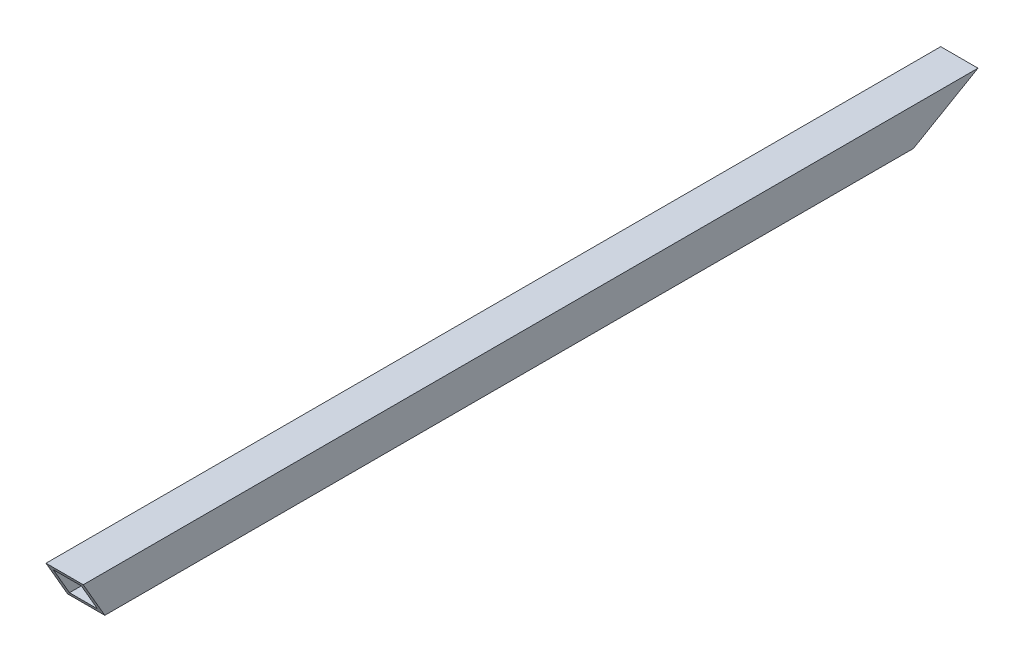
ISO-10303-21;
HEADER;
FILE_DESCRIPTION(('STEP AP214'),'2;1');
FILE_NAME('part.step','',(''),(''),'','','');
FILE_SCHEMA(('AUTOMOTIVE_DESIGN { 1 0 10303 214 1 1 1 1 }'));
ENDSEC;
DATA;
#1=APPLICATION_CONTEXT('core data for automotive mechanical design processes');
#2=APPLICATION_PROTOCOL_DEFINITION('international standard','automotive_design',2000,#1);
#3=PRODUCT_CONTEXT('',#1,'mechanical');
#4=PRODUCT('Part','Part','',(#3));
#5=PRODUCT_RELATED_PRODUCT_CATEGORY('part','',(#4));
#6=PRODUCT_DEFINITION_FORMATION('','',#4);
#7=PRODUCT_DEFINITION_CONTEXT('part definition',#1,'design');
#8=PRODUCT_DEFINITION('design','',#6,#7);
#9=PRODUCT_DEFINITION_SHAPE('','',#8);
#10=(LENGTH_UNIT() NAMED_UNIT(*) SI_UNIT(.MILLI.,.METRE.));
#11=(NAMED_UNIT(*) PLANE_ANGLE_UNIT() SI_UNIT($,.RADIAN.));
#12=(NAMED_UNIT(*) SI_UNIT($,.STERADIAN.) SOLID_ANGLE_UNIT());
#13=UNCERTAINTY_MEASURE_WITH_UNIT(LENGTH_MEASURE(1.E-05),#10,'distance_accuracy_value','');
#14=(GEOMETRIC_REPRESENTATION_CONTEXT(3) GLOBAL_UNCERTAINTY_ASSIGNED_CONTEXT((#13)) GLOBAL_UNIT_ASSIGNED_CONTEXT((#10,
#11,#12)) REPRESENTATION_CONTEXT('',''));
#15=CARTESIAN_POINT('',(0.,0.,0.));
#16=DIRECTION('',(0.,0.,1.));
#17=DIRECTION('',(1.,0.,0.));
#18=AXIS2_PLACEMENT_3D('',#15,#16,#17);
#19=CARTESIAN_POINT('',(-12.7000000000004,-12.7000000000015,-609.599999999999));
#20=DIRECTION('',(-1.,0.,0.));
#21=DIRECTION('',(0.,0.,1.));
#22=AXIS2_PLACEMENT_3D('',#19,#20,#21);
#23=PLANE('',#22);
#24=DIRECTION('',(0.,0.,1.));
#25=VECTOR('',#24,1.);
#26=CARTESIAN_POINT('',(-12.6999999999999,12.6999999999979,-609.599999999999));
#27=LINE('',#26,#25);
#28=CARTESIAN_POINT('',(-12.6999999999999,12.6999999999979,-609.599999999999));
#29=VERTEX_POINT('',#28);
#30=CARTESIAN_POINT('',(-12.7000000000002,12.7000000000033,5.55111512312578E-12));
#31=VERTEX_POINT('',#30);
#32=EDGE_CURVE('E123',#29,#31,#27,.T.);
#33=ORIENTED_EDGE('',*,*,#32,.F.);
#34=DIRECTION('',(0.,-0.500000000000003,0.866025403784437));
#35=VECTOR('',#34,1.);
#36=CARTESIAN_POINT('',(-12.6999999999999,6.34999999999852,-598.601477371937));
#37=LINE('',#36,#35);
#38=CARTESIAN_POINT('',(-12.6999999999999,-12.6999999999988,-565.605909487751));
#39=VERTEX_POINT('',#38);
#40=EDGE_CURVE('E105',#29,#39,#37,.T.);
#41=ORIENTED_EDGE('',*,*,#40,.T.);
#42=DIRECTION('',(0.,0.,1.));
#43=VECTOR('',#42,1.);
#44=CARTESIAN_POINT('',(-12.7000000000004,-12.7000000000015,-609.599999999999));
#45=LINE('',#44,#43);
#46=CARTESIAN_POINT('',(-12.7000000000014,-12.6999999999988,-14.6646968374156));
#47=VERTEX_POINT('',#46);
#48=EDGE_CURVE('E109',#39,#47,#45,.T.);
#49=ORIENTED_EDGE('',*,*,#48,.T.);
#50=DIRECTION('',(0.,-0.866025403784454,-0.500000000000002));
#51=VECTOR('',#50,1.);
#52=CARTESIAN_POINT('',(-12.7000000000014,-270.314543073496,-163.39852262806));
#53=LINE('',#52,#51);
#54=EDGE_CURVE('E151',#31,#47,#53,.T.);
#55=ORIENTED_EDGE('',*,*,#54,.F.);
#56=EDGE_LOOP('',(#33,#41,#49,#55));
#57=FACE_BOUND('',#56,.T.);
#58=ADVANCED_FACE('F34',(#57),#23,.T.);
#59=CARTESIAN_POINT('',(12.699999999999,-12.7000000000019,-609.599999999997));
#60=DIRECTION('',(1.,0.,0.));
#61=DIRECTION('',(0.,1.00000000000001,0.));
#62=AXIS2_PLACEMENT_3D('',#59,#60,#61);
#63=PLANE('',#62);
#64=DIRECTION('',(0.,0.,1.));
#65=VECTOR('',#64,1.);
#66=CARTESIAN_POINT('',(12.699999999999,-12.7000000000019,-609.599999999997));
#67=LINE('',#66,#65);
#68=CARTESIAN_POINT('',(12.7,-12.7000000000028,-565.605909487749));
#69=VERTEX_POINT('',#68);
#70=CARTESIAN_POINT('',(12.7000000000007,-12.6999999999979,-14.6646968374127));
#71=VERTEX_POINT('',#70);
#72=EDGE_CURVE('E118',#69,#71,#67,.T.);
#73=ORIENTED_EDGE('',*,*,#72,.F.);
#74=DIRECTION('',(0.,0.500000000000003,-0.866025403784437));
#75=VECTOR('',#74,1.);
#76=CARTESIAN_POINT('',(12.6999999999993,6.34999999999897,-598.601477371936));
#77=LINE('',#76,#75);
#78=CARTESIAN_POINT('',(12.7,12.6999999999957,-609.599999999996));
#79=VERTEX_POINT('',#78);
#80=EDGE_CURVE('E102',#69,#79,#77,.T.);
#81=ORIENTED_EDGE('',*,*,#80,.T.);
#82=DIRECTION('',(0.,0.,1.));
#83=VECTOR('',#82,1.);
#84=CARTESIAN_POINT('',(12.7,12.6999999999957,-609.599999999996));
#85=LINE('',#84,#83);
#86=CARTESIAN_POINT('',(12.7,12.7000000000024,6.55031584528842E-12));
#87=VERTEX_POINT('',#86);
#88=EDGE_CURVE('E116',#79,#87,#85,.T.);
#89=ORIENTED_EDGE('',*,*,#88,.T.);
#90=DIRECTION('',(0.,0.866025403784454,0.500000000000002));
#91=VECTOR('',#90,1.);
#92=CARTESIAN_POINT('',(12.7000000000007,-270.314543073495,-163.398522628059));
#93=LINE('',#92,#91);
#94=EDGE_CURVE('E148',#71,#87,#93,.T.);
#95=ORIENTED_EDGE('',*,*,#94,.F.);
#96=EDGE_LOOP('',(#73,#81,#89,#95));
#97=FACE_BOUND('',#96,.T.);
#98=ADVANCED_FACE('F114',(#97),#63,.T.);
#99=CARTESIAN_POINT('',(-12.7000000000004,-12.7000000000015,-609.599999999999));
#100=DIRECTION('',(0.,-1.00000000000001,0.));
#101=DIRECTION('',(0.,0.,-1.));
#102=AXIS2_PLACEMENT_3D('',#99,#100,#101);
#103=PLANE('',#102);
#104=ORIENTED_EDGE('',*,*,#48,.F.);
#105=DIRECTION('',(-1.,0.,0.));
#106=VECTOR('',#105,1.);
#107=CARTESIAN_POINT('',(807.771770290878,-12.6999999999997,-565.605909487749));
#108=LINE('',#107,#106);
#109=EDGE_CURVE('E177',#69,#39,#108,.T.);
#110=ORIENTED_EDGE('',*,*,#109,.F.);
#111=ORIENTED_EDGE('',*,*,#72,.T.);
#112=DIRECTION('',(-1.,0.,0.));
#113=VECTOR('',#112,1.);
#114=CARTESIAN_POINT('',(807.771770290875,-12.6999999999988,-14.6646968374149));
#115=LINE('',#114,#113);
#116=EDGE_CURVE('E166',#71,#47,#115,.T.);
#117=ORIENTED_EDGE('',*,*,#116,.T.);
#118=EDGE_LOOP('',(#104,#110,#111,#117));
#119=FACE_BOUND('',#118,.T.);
#120=ADVANCED_FACE('F179',(#119),#103,.T.);
#121=CARTESIAN_POINT('',(-9.5250000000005,-9.52500000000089,-609.599999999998));
#122=DIRECTION('',(0.,-1.00000000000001,0.));
#123=DIRECTION('',(0.,0.,-1.));
#124=AXIS2_PLACEMENT_3D('',#121,#122,#123);
#125=PLANE('',#124);
#126=DIRECTION('',(1.,0.,0.));
#127=VECTOR('',#126,1.);
#128=CARTESIAN_POINT('',(-9.52500000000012,-9.52500000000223,-571.105170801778));
#129=LINE('',#128,#127);
#130=CARTESIAN_POINT('',(-9.52500000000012,-9.52500000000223,-571.105170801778));
#131=VERTEX_POINT('',#130);
#132=CARTESIAN_POINT('',(9.52500000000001,-9.52500000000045,-571.105170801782));
#133=VERTEX_POINT('',#132);
#134=EDGE_CURVE('E48',#131,#133,#129,.T.);
#135=ORIENTED_EDGE('',*,*,#134,.F.);
#136=DIRECTION('',(0.,0.,1.));
#137=VECTOR('',#136,1.);
#138=CARTESIAN_POINT('',(-9.5250000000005,-9.52500000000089,-609.599999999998));
#139=LINE('',#138,#137);
#140=CARTESIAN_POINT('',(-9.52500000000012,-9.5249999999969,-12.8316097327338));
#141=VERTEX_POINT('',#140);
#142=EDGE_CURVE('E147',#131,#141,#139,.T.);
#143=ORIENTED_EDGE('',*,*,#142,.T.);
#144=DIRECTION('',(1.,0.,0.));
#145=VECTOR('',#144,1.);
#146=CARTESIAN_POINT('',(-9.52500000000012,-9.5249999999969,-12.8316097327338));
#147=LINE('',#146,#145);
#148=CARTESIAN_POINT('',(9.52500000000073,-9.52499999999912,-12.8316097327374));
#149=VERTEX_POINT('',#148);
#150=EDGE_CURVE('E142',#141,#149,#147,.T.);
#151=ORIENTED_EDGE('',*,*,#150,.T.);
#152=DIRECTION('',(0.,0.,1.));
#153=VECTOR('',#152,1.);
#154=CARTESIAN_POINT('',(9.52499999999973,-9.52499999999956,-609.600000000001));
#155=LINE('',#154,#153);
#156=EDGE_CURVE('E135',#133,#149,#155,.T.);
#157=ORIENTED_EDGE('',*,*,#156,.F.);
#158=EDGE_LOOP('',(#135,#143,#151,#157));
#159=FACE_BOUND('',#158,.T.);
#160=ADVANCED_FACE('F146',(#159),#125,.F.);
#161=CARTESIAN_POINT('',(-9.5250000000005,-9.52500000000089,-609.599999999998));
#162=DIRECTION('',(-1.,0.,0.));
#163=DIRECTION('',(0.,0.,1.));
#164=AXIS2_PLACEMENT_3D('',#161,#162,#163);
#165=PLANE('',#164);
#166=DIRECTION('',(0.,-0.500000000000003,0.866025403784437));
#167=VECTOR('',#166,1.);
#168=CARTESIAN_POINT('',(-9.5249999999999,7.14374999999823,-599.976292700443));
#169=LINE('',#168,#167);
#170=CARTESIAN_POINT('',(-9.52500000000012,9.52499999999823,-604.100738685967));
#171=VERTEX_POINT('',#170);
#172=EDGE_CURVE('E55',#171,#131,#169,.T.);
#173=ORIENTED_EDGE('',*,*,#172,.F.);
#174=DIRECTION('',(0.,0.,1.));
#175=VECTOR('',#174,1.);
#176=CARTESIAN_POINT('',(-9.52500000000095,9.5249999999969,-609.599999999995));
#177=LINE('',#176,#175);
#178=CARTESIAN_POINT('',(-9.5249999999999,9.52500000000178,-1.83308710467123));
#179=VERTEX_POINT('',#178);
#180=EDGE_CURVE('E159',#171,#179,#177,.T.);
#181=ORIENTED_EDGE('',*,*,#180,.T.);
#182=DIRECTION('',(0.,-0.866025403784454,-0.500000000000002));
#183=VECTOR('',#182,1.);
#184=CARTESIAN_POINT('',(-9.52500000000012,-267.9332930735,-162.023707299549));
#185=LINE('',#184,#183);
#186=EDGE_CURVE('E149',#179,#141,#185,.T.);
#187=ORIENTED_EDGE('',*,*,#186,.T.);
#188=ORIENTED_EDGE('',*,*,#142,.F.);
#189=EDGE_LOOP('',(#173,#181,#187,#188));
#190=FACE_BOUND('',#189,.T.);
#191=ADVANCED_FACE('F185',(#190),#165,.F.);
#192=CARTESIAN_POINT('',(-9.52500000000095,9.5249999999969,-609.599999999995));
#193=DIRECTION('',(0.,1.00000000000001,0.));
#194=DIRECTION('',(0.,0.,1.));
#195=AXIS2_PLACEMENT_3D('',#192,#193,#194);
#196=PLANE('',#195);
#197=DIRECTION('',(-1.,0.,0.));
#198=VECTOR('',#197,1.);
#199=CARTESIAN_POINT('',(-9.52500000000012,9.52499999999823,-604.100738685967));
#200=LINE('',#199,#198);
#201=CARTESIAN_POINT('',(9.52500000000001,9.52500000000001,-604.100738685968));
#202=VERTEX_POINT('',#201);
#203=EDGE_CURVE('E174',#202,#171,#200,.T.);
#204=ORIENTED_EDGE('',*,*,#203,.F.);
#205=DIRECTION('',(0.,0.,1.));
#206=VECTOR('',#205,1.);
#207=CARTESIAN_POINT('',(9.52499999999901,9.52499999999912,-609.599999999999));
#208=LINE('',#207,#206);
#209=CARTESIAN_POINT('',(9.52500000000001,9.52500000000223,-1.83308710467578));
#210=VERTEX_POINT('',#209);
#211=EDGE_CURVE('E133',#202,#210,#208,.T.);
#212=ORIENTED_EDGE('',*,*,#211,.T.);
#213=DIRECTION('',(-1.,0.,0.));
#214=VECTOR('',#213,1.);
#215=CARTESIAN_POINT('',(-9.5249999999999,9.52500000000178,-1.83308710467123));
#216=LINE('',#215,#214);
#217=EDGE_CURVE('E145',#210,#179,#216,.T.);
#218=ORIENTED_EDGE('',*,*,#217,.T.);
#219=ORIENTED_EDGE('',*,*,#180,.F.);
#220=EDGE_LOOP('',(#204,#212,#218,#219));
#221=FACE_BOUND('',#220,.T.);
#222=ADVANCED_FACE('F214',(#221),#196,.F.);
#223=CARTESIAN_POINT('',(9.52499999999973,-9.52499999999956,-609.600000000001));
#224=DIRECTION('',(1.,0.,0.));
#225=DIRECTION('',(0.,1.00000000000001,0.));
#226=AXIS2_PLACEMENT_3D('',#223,#224,#225);
#227=PLANE('',#226);
#228=DIRECTION('',(0.,0.500000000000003,-0.866025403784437));
#229=VECTOR('',#228,1.);
#230=CARTESIAN_POINT('',(9.52500000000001,7.14375000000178,-599.976292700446));
#231=LINE('',#230,#229);
#232=EDGE_CURVE('E11',#133,#202,#231,.T.);
#233=ORIENTED_EDGE('',*,*,#232,.F.);
#234=ORIENTED_EDGE('',*,*,#156,.T.);
#235=DIRECTION('',(0.,0.866025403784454,0.500000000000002));
#236=VECTOR('',#235,1.);
#237=CARTESIAN_POINT('',(9.52500000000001,-267.933293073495,-162.023707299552));
#238=LINE('',#237,#236);
#239=EDGE_CURVE('E41',#149,#210,#238,.T.);
#240=ORIENTED_EDGE('',*,*,#239,.T.);
#241=ORIENTED_EDGE('',*,*,#211,.F.);
#242=EDGE_LOOP('',(#233,#234,#240,#241));
#243=FACE_BOUND('',#242,.T.);
#244=ADVANCED_FACE('F132',(#243),#227,.F.);
#245=CARTESIAN_POINT('',(-12.6999999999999,12.6999999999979,-609.599999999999));
#246=DIRECTION('',(0.,1.00000000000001,0.));
#247=DIRECTION('',(0.,0.,1.));
#248=AXIS2_PLACEMENT_3D('',#245,#246,#247);
#249=PLANE('',#248);
#250=DIRECTION('',(-1.,0.,0.));
#251=VECTOR('',#250,1.);
#252=CARTESIAN_POINT('',(-12.7,12.7000000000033,5.55111512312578E-12));
#253=LINE('',#252,#251);
#254=EDGE_CURVE('E110',#87,#31,#253,.T.);
#255=ORIENTED_EDGE('',*,*,#254,.F.);
#256=ORIENTED_EDGE('',*,*,#88,.F.);
#257=DIRECTION('',(-1.,0.,0.));
#258=VECTOR('',#257,1.);
#259=CARTESIAN_POINT('',(-12.6999999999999,12.6999999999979,-609.599999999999));
#260=LINE('',#259,#258);
#261=EDGE_CURVE('E98',#79,#29,#260,.T.);
#262=ORIENTED_EDGE('',*,*,#261,.T.);
#263=ORIENTED_EDGE('',*,*,#32,.T.);
#264=EDGE_LOOP('',(#255,#256,#262,#263));
#265=FACE_BOUND('',#264,.T.);
#266=ADVANCED_FACE('F120',(#265),#249,.T.);
#267=CARTESIAN_POINT('',(807.771770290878,12.7000000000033,5.32907051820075E-12));
#268=DIRECTION('',(0.,0.499999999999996,-0.866025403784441));
#269=DIRECTION('',(0.,0.866025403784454,0.500000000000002));
#270=AXIS2_PLACEMENT_3D('',#267,#268,#269);
#271=PLANE('',#270);
#272=ORIENTED_EDGE('',*,*,#254,.T.);
#273=ORIENTED_EDGE('',*,*,#54,.T.);
#274=ORIENTED_EDGE('',*,*,#116,.F.);
#275=ORIENTED_EDGE('',*,*,#94,.T.);
#276=EDGE_LOOP('',(#272,#273,#274,#275));
#277=FACE_BOUND('',#276,.T.);
#278=ORIENTED_EDGE('',*,*,#150,.F.);
#279=ORIENTED_EDGE('',*,*,#186,.F.);
#280=ORIENTED_EDGE('',*,*,#217,.F.);
#281=ORIENTED_EDGE('',*,*,#239,.F.);
#282=EDGE_LOOP('',(#278,#279,#280,#281));
#283=FACE_BOUND('',#282,.T.);
#284=ADVANCED_FACE('F140',(#277,#283),#271,.F.);
#285=CARTESIAN_POINT('',(807.771770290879,12.6999999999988,-609.599999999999));
#286=DIRECTION('',(0.,-0.866025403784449,-0.50000000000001));
#287=DIRECTION('',(0.,0.500000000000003,-0.866025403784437));
#288=AXIS2_PLACEMENT_3D('',#285,#286,#287);
#289=PLANE('',#288);
#290=ORIENTED_EDGE('',*,*,#40,.F.);
#291=ORIENTED_EDGE('',*,*,#261,.F.);
#292=ORIENTED_EDGE('',*,*,#80,.F.);
#293=ORIENTED_EDGE('',*,*,#109,.T.);
#294=EDGE_LOOP('',(#290,#291,#292,#293));
#295=FACE_BOUND('',#294,.T.);
#296=ORIENTED_EDGE('',*,*,#172,.T.);
#297=ORIENTED_EDGE('',*,*,#134,.T.);
#298=ORIENTED_EDGE('',*,*,#232,.T.);
#299=ORIENTED_EDGE('',*,*,#203,.T.);
#300=EDGE_LOOP('',(#296,#297,#298,#299));
#301=FACE_BOUND('',#300,.T.);
#302=ADVANCED_FACE('F100',(#295,#301),#289,.T.);
#303=CLOSED_SHELL('',(#58,#98,#120,#160,#191,#222,#244,#266,#284,#302));
#304=MANIFOLD_SOLID_BREP('B2',#303);
#305=ADVANCED_BREP_SHAPE_REPRESENTATION('',(#18,#304),#14);
#306=SHAPE_DEFINITION_REPRESENTATION(#9,#305);
ENDSEC;
END-ISO-10303-21;
